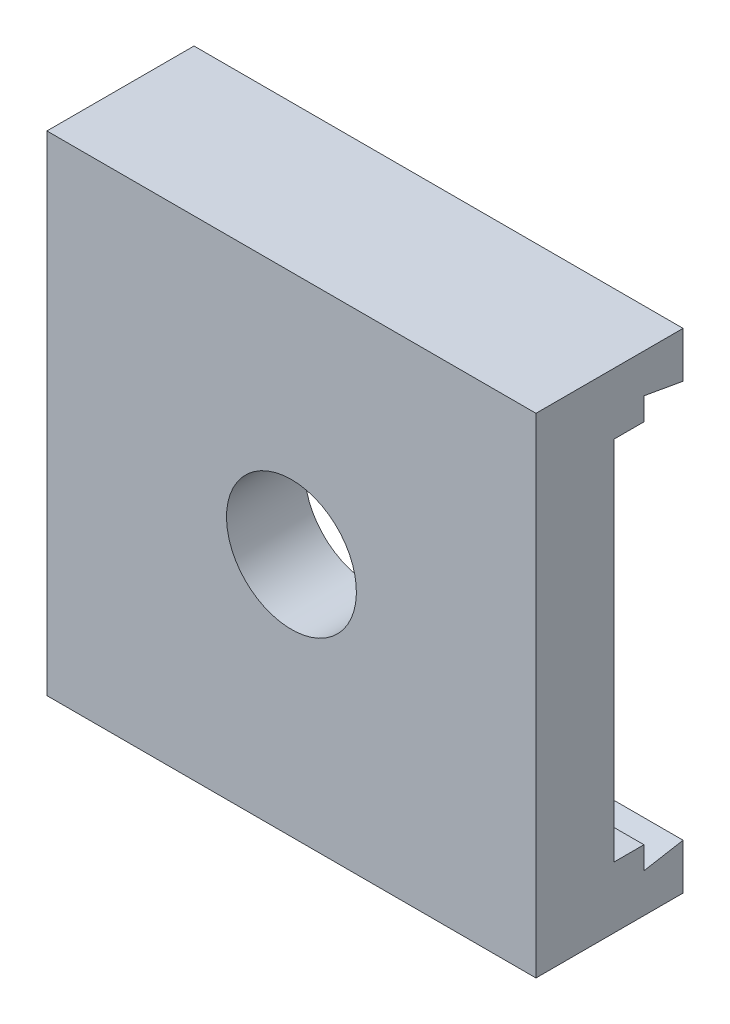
ISO-10303-21;
HEADER;
FILE_DESCRIPTION(('STEP AP214'),'2;1');
FILE_NAME('part.step','',(''),(''),'','','');
FILE_SCHEMA(('AUTOMOTIVE_DESIGN { 1 0 10303 214 1 1 1 1 }'));
ENDSEC;
DATA;
#1=APPLICATION_CONTEXT('core data for automotive mechanical design processes');
#2=APPLICATION_PROTOCOL_DEFINITION('international standard','automotive_design',2000,#1);
#3=PRODUCT_CONTEXT('',#1,'mechanical');
#4=PRODUCT('Part','Part','',(#3));
#5=PRODUCT_RELATED_PRODUCT_CATEGORY('part','',(#4));
#6=PRODUCT_DEFINITION_FORMATION('','',#4);
#7=PRODUCT_DEFINITION_CONTEXT('part definition',#1,'design');
#8=PRODUCT_DEFINITION('design','',#6,#7);
#9=PRODUCT_DEFINITION_SHAPE('','',#8);
#10=(LENGTH_UNIT() NAMED_UNIT(*) SI_UNIT(.MILLI.,.METRE.));
#11=(NAMED_UNIT(*) PLANE_ANGLE_UNIT() SI_UNIT($,.RADIAN.));
#12=(NAMED_UNIT(*) SI_UNIT($,.STERADIAN.) SOLID_ANGLE_UNIT());
#13=UNCERTAINTY_MEASURE_WITH_UNIT(LENGTH_MEASURE(1.E-05),#10,'distance_accuracy_value','');
#14=(GEOMETRIC_REPRESENTATION_CONTEXT(3) GLOBAL_UNCERTAINTY_ASSIGNED_CONTEXT((#13)) GLOBAL_UNIT_ASSIGNED_CONTEXT((#10,
#11,#12)) REPRESENTATION_CONTEXT('',''));
#15=CARTESIAN_POINT('',(0.,0.,0.));
#16=DIRECTION('',(0.,0.,1.));
#17=DIRECTION('',(1.,0.,0.));
#18=AXIS2_PLACEMENT_3D('',#15,#16,#17);
#19=CARTESIAN_POINT('',(-7.9375,-7.9375,2.54));
#20=DIRECTION('',(0.,1.,0.));
#21=DIRECTION('',(-1.,0.,0.));
#22=AXIS2_PLACEMENT_3D('',#19,#20,#21);
#23=PLANE('',#22);
#24=DIRECTION('',(0.,0.,1.));
#25=VECTOR('',#24,1.);
#26=CARTESIAN_POINT('',(7.9375,-7.9375,2.54));
#27=LINE('',#26,#25);
#28=CARTESIAN_POINT('',(7.9375,-7.9375,-2.2352));
#29=VERTEX_POINT('',#28);
#30=CARTESIAN_POINT('',(7.9375,-7.9375,2.54));
#31=VERTEX_POINT('',#30);
#32=EDGE_CURVE('E107',#29,#31,#27,.T.);
#33=ORIENTED_EDGE('',*,*,#32,.T.);
#34=DIRECTION('',(1.,0.,0.));
#35=VECTOR('',#34,1.);
#36=CARTESIAN_POINT('',(-7.9375,-7.9375,2.54));
#37=LINE('',#36,#35);
#38=CARTESIAN_POINT('',(-7.9375,-7.9375,2.54));
#39=VERTEX_POINT('',#38);
#40=EDGE_CURVE('E9',#39,#31,#37,.T.);
#41=ORIENTED_EDGE('',*,*,#40,.F.);
#42=DIRECTION('',(0.,0.,1.));
#43=VECTOR('',#42,1.);
#44=CARTESIAN_POINT('',(-7.9375,-7.9375,2.54));
#45=LINE('',#44,#43);
#46=CARTESIAN_POINT('',(-7.9375,-7.9375,-2.2352));
#47=VERTEX_POINT('',#46);
#48=EDGE_CURVE('E145',#47,#39,#45,.T.);
#49=ORIENTED_EDGE('',*,*,#48,.F.);
#50=DIRECTION('',(1.,0.,0.));
#51=VECTOR('',#50,1.);
#52=CARTESIAN_POINT('',(-7.9375,-7.9375,-2.2352));
#53=LINE('',#52,#51);
#54=EDGE_CURVE('E120',#47,#29,#53,.T.);
#55=ORIENTED_EDGE('',*,*,#54,.T.);
#56=EDGE_LOOP('',(#33,#41,#49,#55));
#57=FACE_BOUND('',#56,.T.);
#58=ADVANCED_FACE('F14',(#57),#23,.F.);
#59=CARTESIAN_POINT('',(-7.9375,7.9375,2.54));
#60=DIRECTION('',(0.,0.,-1.));
#61=DIRECTION('',(0.,-1.,0.));
#62=AXIS2_PLACEMENT_3D('',#59,#60,#61);
#63=PLANE('',#62);
#64=CARTESIAN_POINT('',(0.,0.,2.54));
#65=DIRECTION('',(0.,0.,1.));
#66=DIRECTION('',(0.,1.,0.));
#67=AXIS2_PLACEMENT_3D('',#64,#65,#66);
#68=CIRCLE('',#67,2.1082);
#69=CARTESIAN_POINT('',(0.,2.1082,2.54));
#70=VERTEX_POINT('',#69);
#71=EDGE_CURVE('E123',#70,#70,#68,.T.);
#72=ORIENTED_EDGE('',*,*,#71,.F.);
#73=EDGE_LOOP('',(#72));
#74=FACE_BOUND('',#73,.T.);
#75=DIRECTION('',(0.,1.,0.));
#76=VECTOR('',#75,1.);
#77=CARTESIAN_POINT('',(7.9375,7.9375,2.54));
#78=LINE('',#77,#76);
#79=CARTESIAN_POINT('',(7.9375,7.9375,2.54));
#80=VERTEX_POINT('',#79);
#81=EDGE_CURVE('E103',#31,#80,#78,.T.);
#82=ORIENTED_EDGE('',*,*,#81,.T.);
#83=DIRECTION('',(1.,0.,0.));
#84=VECTOR('',#83,1.);
#85=CARTESIAN_POINT('',(-7.9375,7.9375,2.54));
#86=LINE('',#85,#84);
#87=CARTESIAN_POINT('',(-7.9375,7.9375,2.54));
#88=VERTEX_POINT('',#87);
#89=EDGE_CURVE('E22',#88,#80,#86,.T.);
#90=ORIENTED_EDGE('',*,*,#89,.F.);
#91=DIRECTION('',(0.,1.,0.));
#92=VECTOR('',#91,1.);
#93=CARTESIAN_POINT('',(-7.9375,7.9375,2.54));
#94=LINE('',#93,#92);
#95=EDGE_CURVE('E116',#39,#88,#94,.T.);
#96=ORIENTED_EDGE('',*,*,#95,.F.);
#97=ORIENTED_EDGE('',*,*,#40,.T.);
#98=EDGE_LOOP('',(#82,#90,#96,#97));
#99=FACE_BOUND('',#98,.T.);
#100=ADVANCED_FACE('F115',(#74,#99),#63,.F.);
#101=CARTESIAN_POINT('',(-7.9375,7.9375,2.54));
#102=DIRECTION('',(0.,-1.,0.));
#103=DIRECTION('',(1.,0.,0.));
#104=AXIS2_PLACEMENT_3D('',#101,#102,#103);
#105=PLANE('',#104);
#106=DIRECTION('',(0.,0.,-1.));
#107=VECTOR('',#106,1.);
#108=CARTESIAN_POINT('',(7.9375,7.9375,2.54));
#109=LINE('',#108,#107);
#110=CARTESIAN_POINT('',(7.9375,7.9375,-2.2352));
#111=VERTEX_POINT('',#110);
#112=EDGE_CURVE('E109',#80,#111,#109,.T.);
#113=ORIENTED_EDGE('',*,*,#112,.T.);
#114=DIRECTION('',(1.,0.,0.));
#115=VECTOR('',#114,1.);
#116=CARTESIAN_POINT('',(-7.9375,7.9375,-2.2352));
#117=LINE('',#116,#115);
#118=CARTESIAN_POINT('',(-7.9375,7.9375,-2.2352));
#119=VERTEX_POINT('',#118);
#120=EDGE_CURVE('E191',#119,#111,#117,.T.);
#121=ORIENTED_EDGE('',*,*,#120,.F.);
#122=DIRECTION('',(0.,0.,-1.));
#123=VECTOR('',#122,1.);
#124=CARTESIAN_POINT('',(-7.9375,7.9375,2.54));
#125=LINE('',#124,#123);
#126=EDGE_CURVE('E148',#88,#119,#125,.T.);
#127=ORIENTED_EDGE('',*,*,#126,.F.);
#128=ORIENTED_EDGE('',*,*,#89,.T.);
#129=EDGE_LOOP('',(#113,#121,#127,#128));
#130=FACE_BOUND('',#129,.T.);
#131=ADVANCED_FACE('F196',(#130),#105,.F.);
#132=CARTESIAN_POINT('',(-7.9375,7.9375,-2.2352));
#133=DIRECTION('',(0.,0.,1.));
#134=DIRECTION('',(-1.,0.,0.));
#135=AXIS2_PLACEMENT_3D('',#132,#133,#134);
#136=PLANE('',#135);
#137=DIRECTION('',(0.,-1.,0.));
#138=VECTOR('',#137,1.);
#139=CARTESIAN_POINT('',(7.9375,7.9375,-2.2352));
#140=LINE('',#139,#138);
#141=CARTESIAN_POINT('',(7.9375,6.4516,-2.2352));
#142=VERTEX_POINT('',#141);
#143=EDGE_CURVE('E127',#111,#142,#140,.T.);
#144=ORIENTED_EDGE('',*,*,#143,.T.);
#145=DIRECTION('',(1.,0.,0.));
#146=VECTOR('',#145,1.);
#147=CARTESIAN_POINT('',(-7.9375,6.4516,-2.2352));
#148=LINE('',#147,#146);
#149=CARTESIAN_POINT('',(-7.9375,6.4516,-2.2352));
#150=VERTEX_POINT('',#149);
#151=EDGE_CURVE('E188',#150,#142,#148,.T.);
#152=ORIENTED_EDGE('',*,*,#151,.F.);
#153=DIRECTION('',(0.,-1.,0.));
#154=VECTOR('',#153,1.);
#155=CARTESIAN_POINT('',(-7.9375,7.9375,-2.2352));
#156=LINE('',#155,#154);
#157=EDGE_CURVE('E150',#119,#150,#156,.T.);
#158=ORIENTED_EDGE('',*,*,#157,.F.);
#159=ORIENTED_EDGE('',*,*,#120,.T.);
#160=EDGE_LOOP('',(#144,#152,#158,#159));
#161=FACE_BOUND('',#160,.T.);
#162=ADVANCED_FACE('F204',(#161),#136,.F.);
#163=CARTESIAN_POINT('',(-7.9375,6.4516,-2.2352));
#164=DIRECTION('',(0.,0.984807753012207,-0.173648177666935));
#165=DIRECTION('',(0.,-0.173648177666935,-0.984807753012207));
#166=AXIS2_PLACEMENT_3D('',#163,#164,#165);
#167=PLANE('',#166);
#168=DIRECTION('',(0.,0.173648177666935,0.984807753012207));
#169=VECTOR('',#168,1.);
#170=CARTESIAN_POINT('',(7.9375,6.4516,-2.2352));
#171=LINE('',#170,#169);
#172=CARTESIAN_POINT('',(7.9375,6.67553526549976,-0.9652));
#173=VERTEX_POINT('',#172);
#174=EDGE_CURVE('E129',#142,#173,#171,.T.);
#175=ORIENTED_EDGE('',*,*,#174,.T.);
#176=DIRECTION('',(1.,0.,0.));
#177=VECTOR('',#176,1.);
#178=CARTESIAN_POINT('',(-7.9375,6.67553526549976,-0.9652));
#179=LINE('',#178,#177);
#180=CARTESIAN_POINT('',(-7.9375,6.67553526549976,-0.9652));
#181=VERTEX_POINT('',#180);
#182=EDGE_CURVE('E185',#181,#173,#179,.T.);
#183=ORIENTED_EDGE('',*,*,#182,.F.);
#184=DIRECTION('',(0.,0.173648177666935,0.984807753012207));
#185=VECTOR('',#184,1.);
#186=CARTESIAN_POINT('',(-7.9375,6.4516,-2.2352));
#187=LINE('',#186,#185);
#188=EDGE_CURVE('E152',#150,#181,#187,.T.);
#189=ORIENTED_EDGE('',*,*,#188,.F.);
#190=ORIENTED_EDGE('',*,*,#151,.T.);
#191=EDGE_LOOP('',(#175,#183,#189,#190));
#192=FACE_BOUND('',#191,.T.);
#193=ADVANCED_FACE('F207',(#192),#167,.F.);
#194=CARTESIAN_POINT('',(-7.9375,6.67553526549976,-0.9652));
#195=DIRECTION('',(0.,0.,1.));
#196=DIRECTION('',(0.,1.,0.));
#197=AXIS2_PLACEMENT_3D('',#194,#195,#196);
#198=PLANE('',#197);
#199=DIRECTION('',(0.,-1.,0.));
#200=VECTOR('',#199,1.);
#201=CARTESIAN_POINT('',(7.9375,6.67553526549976,-0.9652));
#202=LINE('',#201,#200);
#203=CARTESIAN_POINT('',(7.9375,5.9436,-0.9652));
#204=VERTEX_POINT('',#203);
#205=EDGE_CURVE('E131',#173,#204,#202,.T.);
#206=ORIENTED_EDGE('',*,*,#205,.T.);
#207=DIRECTION('',(1.,0.,0.));
#208=VECTOR('',#207,1.);
#209=CARTESIAN_POINT('',(-7.9375,5.9436,-0.9652));
#210=LINE('',#209,#208);
#211=CARTESIAN_POINT('',(-7.9375,5.9436,-0.9652));
#212=VERTEX_POINT('',#211);
#213=EDGE_CURVE('E182',#212,#204,#210,.T.);
#214=ORIENTED_EDGE('',*,*,#213,.F.);
#215=DIRECTION('',(0.,-1.,0.));
#216=VECTOR('',#215,1.);
#217=CARTESIAN_POINT('',(-7.9375,6.67553526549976,-0.9652));
#218=LINE('',#217,#216);
#219=EDGE_CURVE('E154',#181,#212,#218,.T.);
#220=ORIENTED_EDGE('',*,*,#219,.F.);
#221=ORIENTED_EDGE('',*,*,#182,.T.);
#222=EDGE_LOOP('',(#206,#214,#220,#221));
#223=FACE_BOUND('',#222,.T.);
#224=ADVANCED_FACE('F212',(#223),#198,.F.);
#225=CARTESIAN_POINT('',(-7.9375,5.9436,-0.9652));
#226=DIRECTION('',(0.,1.,0.));
#227=DIRECTION('',(-1.,0.,0.));
#228=AXIS2_PLACEMENT_3D('',#225,#226,#227);
#229=PLANE('',#228);
#230=DIRECTION('',(0.,0.,1.));
#231=VECTOR('',#230,1.);
#232=CARTESIAN_POINT('',(7.9375,5.9436,-0.9652));
#233=LINE('',#232,#231);
#234=CARTESIAN_POINT('',(7.9375,5.9436,0.));
#235=VERTEX_POINT('',#234);
#236=EDGE_CURVE('E133',#204,#235,#233,.T.);
#237=ORIENTED_EDGE('',*,*,#236,.T.);
#238=DIRECTION('',(1.,0.,0.));
#239=VECTOR('',#238,1.);
#240=CARTESIAN_POINT('',(-7.9375,5.9436,0.));
#241=LINE('',#240,#239);
#242=CARTESIAN_POINT('',(-7.9375,5.9436,0.));
#243=VERTEX_POINT('',#242);
#244=EDGE_CURVE('E179',#243,#235,#241,.T.);
#245=ORIENTED_EDGE('',*,*,#244,.F.);
#246=DIRECTION('',(0.,0.,1.));
#247=VECTOR('',#246,1.);
#248=CARTESIAN_POINT('',(-7.9375,5.9436,-0.9652));
#249=LINE('',#248,#247);
#250=EDGE_CURVE('E156',#212,#243,#249,.T.);
#251=ORIENTED_EDGE('',*,*,#250,.F.);
#252=ORIENTED_EDGE('',*,*,#213,.T.);
#253=EDGE_LOOP('',(#237,#245,#251,#252));
#254=FACE_BOUND('',#253,.T.);
#255=ADVANCED_FACE('F218',(#254),#229,.F.);
#256=CARTESIAN_POINT('',(-7.9375,-5.9436,0.));
#257=DIRECTION('',(0.,0.,1.));
#258=DIRECTION('',(-1.,0.,0.));
#259=AXIS2_PLACEMENT_3D('',#256,#257,#258);
#260=PLANE('',#259);
#261=CARTESIAN_POINT('',(0.,0.,0.));
#262=DIRECTION('',(0.,0.,1.));
#263=DIRECTION('',(-1.,0.,0.));
#264=AXIS2_PLACEMENT_3D('',#261,#262,#263);
#265=CIRCLE('',#264,2.1082);
#266=CARTESIAN_POINT('',(-2.1082,0.,0.));
#267=VERTEX_POINT('',#266);
#268=EDGE_CURVE('E17',#267,#267,#265,.T.);
#269=ORIENTED_EDGE('',*,*,#268,.T.);
#270=EDGE_LOOP('',(#269));
#271=FACE_BOUND('',#270,.T.);
#272=DIRECTION('',(0.,-1.,0.));
#273=VECTOR('',#272,1.);
#274=CARTESIAN_POINT('',(7.9375,-5.9436,0.));
#275=LINE('',#274,#273);
#276=CARTESIAN_POINT('',(7.9375,-5.9436,0.));
#277=VERTEX_POINT('',#276);
#278=EDGE_CURVE('E135',#235,#277,#275,.T.);
#279=ORIENTED_EDGE('',*,*,#278,.T.);
#280=DIRECTION('',(1.,0.,0.));
#281=VECTOR('',#280,1.);
#282=CARTESIAN_POINT('',(-7.9375,-5.9436,0.));
#283=LINE('',#282,#281);
#284=CARTESIAN_POINT('',(-7.9375,-5.9436,0.));
#285=VERTEX_POINT('',#284);
#286=EDGE_CURVE('E176',#285,#277,#283,.T.);
#287=ORIENTED_EDGE('',*,*,#286,.F.);
#288=DIRECTION('',(0.,-1.,0.));
#289=VECTOR('',#288,1.);
#290=CARTESIAN_POINT('',(-7.9375,-5.9436,0.));
#291=LINE('',#290,#289);
#292=EDGE_CURVE('E158',#243,#285,#291,.T.);
#293=ORIENTED_EDGE('',*,*,#292,.F.);
#294=ORIENTED_EDGE('',*,*,#244,.T.);
#295=EDGE_LOOP('',(#279,#287,#293,#294));
#296=FACE_BOUND('',#295,.T.);
#297=ADVANCED_FACE('F222',(#271,#296),#260,.F.);
#298=CARTESIAN_POINT('',(-7.9375,-5.9436,-0.9652));
#299=DIRECTION('',(0.,-1.,0.));
#300=DIRECTION('',(1.,0.,0.));
#301=AXIS2_PLACEMENT_3D('',#298,#299,#300);
#302=PLANE('',#301);
#303=DIRECTION('',(0.,0.,-1.));
#304=VECTOR('',#303,1.);
#305=CARTESIAN_POINT('',(7.9375,-5.9436,-0.9652));
#306=LINE('',#305,#304);
#307=CARTESIAN_POINT('',(7.9375,-5.9436,-0.9652));
#308=VERTEX_POINT('',#307);
#309=EDGE_CURVE('E137',#277,#308,#306,.T.);
#310=ORIENTED_EDGE('',*,*,#309,.T.);
#311=DIRECTION('',(1.,0.,0.));
#312=VECTOR('',#311,1.);
#313=CARTESIAN_POINT('',(-7.9375,-5.9436,-0.9652));
#314=LINE('',#313,#312);
#315=CARTESIAN_POINT('',(-7.9375,-5.9436,-0.9652));
#316=VERTEX_POINT('',#315);
#317=EDGE_CURVE('E173',#316,#308,#314,.T.);
#318=ORIENTED_EDGE('',*,*,#317,.F.);
#319=DIRECTION('',(0.,0.,-1.));
#320=VECTOR('',#319,1.);
#321=CARTESIAN_POINT('',(-7.9375,-5.9436,-0.9652));
#322=LINE('',#321,#320);
#323=EDGE_CURVE('E160',#285,#316,#322,.T.);
#324=ORIENTED_EDGE('',*,*,#323,.F.);
#325=ORIENTED_EDGE('',*,*,#286,.T.);
#326=EDGE_LOOP('',(#310,#318,#324,#325));
#327=FACE_BOUND('',#326,.T.);
#328=ADVANCED_FACE('F227',(#327),#302,.F.);
#329=CARTESIAN_POINT('',(-7.9375,-6.67553526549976,-0.9652));
#330=DIRECTION('',(0.,0.,1.));
#331=DIRECTION('',(-1.,0.,0.));
#332=AXIS2_PLACEMENT_3D('',#329,#330,#331);
#333=PLANE('',#332);
#334=DIRECTION('',(0.,-1.,0.));
#335=VECTOR('',#334,1.);
#336=CARTESIAN_POINT('',(7.9375,-6.67553526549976,-0.9652));
#337=LINE('',#336,#335);
#338=CARTESIAN_POINT('',(7.9375,-6.67553526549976,-0.9652));
#339=VERTEX_POINT('',#338);
#340=EDGE_CURVE('E139',#308,#339,#337,.T.);
#341=ORIENTED_EDGE('',*,*,#340,.T.);
#342=DIRECTION('',(1.,0.,0.));
#343=VECTOR('',#342,1.);
#344=CARTESIAN_POINT('',(-7.9375,-6.67553526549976,-0.9652));
#345=LINE('',#344,#343);
#346=CARTESIAN_POINT('',(-7.9375,-6.67553526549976,-0.9652));
#347=VERTEX_POINT('',#346);
#348=EDGE_CURVE('E170',#347,#339,#345,.T.);
#349=ORIENTED_EDGE('',*,*,#348,.F.);
#350=DIRECTION('',(0.,-1.,0.));
#351=VECTOR('',#350,1.);
#352=CARTESIAN_POINT('',(-7.9375,-6.67553526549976,-0.9652));
#353=LINE('',#352,#351);
#354=EDGE_CURVE('E162',#316,#347,#353,.T.);
#355=ORIENTED_EDGE('',*,*,#354,.F.);
#356=ORIENTED_EDGE('',*,*,#317,.T.);
#357=EDGE_LOOP('',(#341,#349,#355,#356));
#358=FACE_BOUND('',#357,.T.);
#359=ADVANCED_FACE('F231',(#358),#333,.F.);
#360=CARTESIAN_POINT('',(-7.9375,-6.4516,-2.2352));
#361=DIRECTION('',(0.,-0.984807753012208,-0.173648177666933));
#362=DIRECTION('',(0.,-0.173648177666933,0.984807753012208));
#363=AXIS2_PLACEMENT_3D('',#360,#361,#362);
#364=PLANE('',#363);
#365=DIRECTION('',(0.,0.173648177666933,-0.984807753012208));
#366=VECTOR('',#365,1.);
#367=CARTESIAN_POINT('',(7.9375,-6.4516,-2.2352));
#368=LINE('',#367,#366);
#369=CARTESIAN_POINT('',(7.9375,-6.4516,-2.2352));
#370=VERTEX_POINT('',#369);
#371=EDGE_CURVE('E141',#339,#370,#368,.T.);
#372=ORIENTED_EDGE('',*,*,#371,.T.);
#373=DIRECTION('',(1.,0.,0.));
#374=VECTOR('',#373,1.);
#375=CARTESIAN_POINT('',(-7.9375,-6.4516,-2.2352));
#376=LINE('',#375,#374);
#377=CARTESIAN_POINT('',(-7.9375,-6.4516,-2.2352));
#378=VERTEX_POINT('',#377);
#379=EDGE_CURVE('E167',#378,#370,#376,.T.);
#380=ORIENTED_EDGE('',*,*,#379,.F.);
#381=DIRECTION('',(0.,0.173648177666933,-0.984807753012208));
#382=VECTOR('',#381,1.);
#383=CARTESIAN_POINT('',(-7.9375,-6.4516,-2.2352));
#384=LINE('',#383,#382);
#385=EDGE_CURVE('E34',#347,#378,#384,.T.);
#386=ORIENTED_EDGE('',*,*,#385,.F.);
#387=ORIENTED_EDGE('',*,*,#348,.T.);
#388=EDGE_LOOP('',(#372,#380,#386,#387));
#389=FACE_BOUND('',#388,.T.);
#390=ADVANCED_FACE('F235',(#389),#364,.F.);
#391=CARTESIAN_POINT('',(-7.9375,-7.9375,-2.2352));
#392=DIRECTION('',(0.,0.,1.));
#393=DIRECTION('',(-1.,0.,0.));
#394=AXIS2_PLACEMENT_3D('',#391,#392,#393);
#395=PLANE('',#394);
#396=DIRECTION('',(0.,-1.,0.));
#397=VECTOR('',#396,1.);
#398=CARTESIAN_POINT('',(7.9375,-7.9375,-2.2352));
#399=LINE('',#398,#397);
#400=EDGE_CURVE('E143',#370,#29,#399,.T.);
#401=ORIENTED_EDGE('',*,*,#400,.T.);
#402=ORIENTED_EDGE('',*,*,#54,.F.);
#403=DIRECTION('',(0.,-1.,0.));
#404=VECTOR('',#403,1.);
#405=CARTESIAN_POINT('',(-7.9375,-7.9375,-2.2352));
#406=LINE('',#405,#404);
#407=EDGE_CURVE('E29',#378,#47,#406,.T.);
#408=ORIENTED_EDGE('',*,*,#407,.F.);
#409=ORIENTED_EDGE('',*,*,#379,.T.);
#410=EDGE_LOOP('',(#401,#402,#408,#409));
#411=FACE_BOUND('',#410,.T.);
#412=ADVANCED_FACE('F237',(#411),#395,.F.);
#413=CARTESIAN_POINT('',(-7.9375,-7.9375,-2.2352));
#414=DIRECTION('',(1.,0.,0.));
#415=DIRECTION('',(0.,1.,0.));
#416=AXIS2_PLACEMENT_3D('',#413,#414,#415);
#417=PLANE('',#416);
#418=ORIENTED_EDGE('',*,*,#48,.T.);
#419=ORIENTED_EDGE('',*,*,#95,.T.);
#420=ORIENTED_EDGE('',*,*,#126,.T.);
#421=ORIENTED_EDGE('',*,*,#157,.T.);
#422=ORIENTED_EDGE('',*,*,#188,.T.);
#423=ORIENTED_EDGE('',*,*,#219,.T.);
#424=ORIENTED_EDGE('',*,*,#250,.T.);
#425=ORIENTED_EDGE('',*,*,#292,.T.);
#426=ORIENTED_EDGE('',*,*,#323,.T.);
#427=ORIENTED_EDGE('',*,*,#354,.T.);
#428=ORIENTED_EDGE('',*,*,#385,.T.);
#429=ORIENTED_EDGE('',*,*,#407,.T.);
#430=EDGE_LOOP('',(#418,#419,#420,#421,#422,#423,#424,#425,#426,#427,#428,#429));
#431=FACE_BOUND('',#430,.T.);
#432=ADVANCED_FACE('F199',(#431),#417,.F.);
#433=CARTESIAN_POINT('',(7.9375,-7.9375,-2.2352));
#434=DIRECTION('',(1.,0.,0.));
#435=DIRECTION('',(0.,1.,0.));
#436=AXIS2_PLACEMENT_3D('',#433,#434,#435);
#437=PLANE('',#436);
#438=ORIENTED_EDGE('',*,*,#32,.F.);
#439=ORIENTED_EDGE('',*,*,#400,.F.);
#440=ORIENTED_EDGE('',*,*,#371,.F.);
#441=ORIENTED_EDGE('',*,*,#340,.F.);
#442=ORIENTED_EDGE('',*,*,#309,.F.);
#443=ORIENTED_EDGE('',*,*,#278,.F.);
#444=ORIENTED_EDGE('',*,*,#236,.F.);
#445=ORIENTED_EDGE('',*,*,#205,.F.);
#446=ORIENTED_EDGE('',*,*,#174,.F.);
#447=ORIENTED_EDGE('',*,*,#143,.F.);
#448=ORIENTED_EDGE('',*,*,#112,.F.);
#449=ORIENTED_EDGE('',*,*,#81,.F.);
#450=EDGE_LOOP('',(#438,#439,#440,#441,#442,#443,#444,#445,#446,#447,#448,#449));
#451=FACE_BOUND('',#450,.T.);
#452=ADVANCED_FACE('F104',(#451),#437,.T.);
#453=CARTESIAN_POINT('',(0.,0.,-2.2352));
#454=DIRECTION('',(0.,0.,1.));
#455=DIRECTION('',(0.,1.,0.));
#456=AXIS2_PLACEMENT_3D('',#453,#454,#455);
#457=CYLINDRICAL_SURFACE('',#456,2.1082);
#458=ORIENTED_EDGE('',*,*,#71,.T.);
#459=EDGE_LOOP('',(#458));
#460=FACE_BOUND('',#459,.T.);
#461=ORIENTED_EDGE('',*,*,#268,.F.);
#462=EDGE_LOOP('',(#461));
#463=FACE_BOUND('',#462,.T.);
#464=ADVANCED_FACE('F357',(#460,#463),#457,.F.);
#465=CLOSED_SHELL('',(#58,#100,#131,#162,#193,#224,#255,#297,#328,#359,#390,#412,#432,#452,#464));
#466=MANIFOLD_SOLID_BREP('B1',#465);
#467=ADVANCED_BREP_SHAPE_REPRESENTATION('',(#18,#466),#14);
#468=SHAPE_DEFINITION_REPRESENTATION(#9,#467);
ENDSEC;
END-ISO-10303-21;
